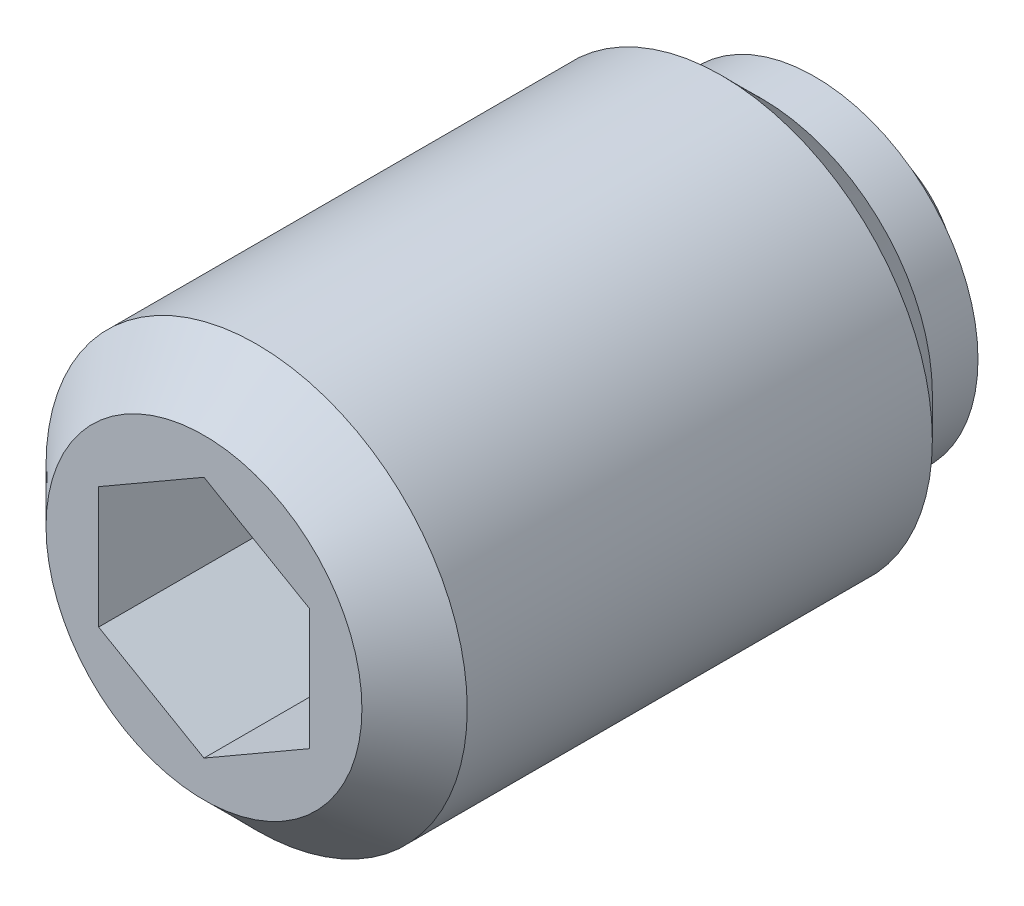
ISO-10303-21;
HEADER;
FILE_DESCRIPTION(('STEP AP214'),'2;1');
FILE_NAME('part.step','',(''),(''),'','','');
FILE_SCHEMA(('AUTOMOTIVE_DESIGN { 1 0 10303 214 1 1 1 1 }'));
ENDSEC;
DATA;
#1=APPLICATION_CONTEXT('core data for automotive mechanical design processes');
#2=APPLICATION_PROTOCOL_DEFINITION('international standard','automotive_design',2000,#1);
#3=PRODUCT_CONTEXT('',#1,'mechanical');
#4=PRODUCT('Part','Part','',(#3));
#5=PRODUCT_RELATED_PRODUCT_CATEGORY('part','',(#4));
#6=PRODUCT_DEFINITION_FORMATION('','',#4);
#7=PRODUCT_DEFINITION_CONTEXT('part definition',#1,'design');
#8=PRODUCT_DEFINITION('design','',#6,#7);
#9=PRODUCT_DEFINITION_SHAPE('','',#8);
#10=(LENGTH_UNIT() NAMED_UNIT(*) SI_UNIT(.MILLI.,.METRE.));
#11=(NAMED_UNIT(*) PLANE_ANGLE_UNIT() SI_UNIT($,.RADIAN.));
#12=(NAMED_UNIT(*) SI_UNIT($,.STERADIAN.) SOLID_ANGLE_UNIT());
#13=UNCERTAINTY_MEASURE_WITH_UNIT(LENGTH_MEASURE(1.E-05),#10,'distance_accuracy_value','');
#14=(GEOMETRIC_REPRESENTATION_CONTEXT(3) GLOBAL_UNCERTAINTY_ASSIGNED_CONTEXT((#13)) GLOBAL_UNIT_ASSIGNED_CONTEXT((#10,
#11,#12)) REPRESENTATION_CONTEXT('',''));
#15=CARTESIAN_POINT('',(0.,0.,0.));
#16=DIRECTION('',(0.,0.,1.));
#17=DIRECTION('',(1.,0.,0.));
#18=AXIS2_PLACEMENT_3D('',#15,#16,#17);
#19=CARTESIAN_POINT('',(0.,0.,10.2));
#20=DIRECTION('',(0.,0.,-1.));
#21=DIRECTION('',(-1.,0.,0.));
#22=AXIS2_PLACEMENT_3D('',#19,#20,#21);
#23=PLANE('',#22);
#24=DIRECTION('',(0.,1.,0.));
#25=VECTOR('',#24,1.);
#26=CARTESIAN_POINT('',(-2.,-1.15470053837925,10.2));
#27=LINE('',#26,#25);
#28=CARTESIAN_POINT('',(-2.,-1.15470053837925,10.2));
#29=VERTEX_POINT('',#28);
#30=CARTESIAN_POINT('',(-2.,1.15470053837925,10.2));
#31=VERTEX_POINT('',#30);
#32=EDGE_CURVE('E80',#29,#31,#27,.T.);
#33=ORIENTED_EDGE('',*,*,#32,.F.);
#34=DIRECTION('',(0.866025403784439,-0.5,0.));
#35=VECTOR('',#34,1.);
#36=CARTESIAN_POINT('',(0.,-2.3094010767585,10.2));
#37=LINE('',#36,#35);
#38=CARTESIAN_POINT('',(0.,-2.3094010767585,10.2));
#39=VERTEX_POINT('',#38);
#40=EDGE_CURVE('E102',#39,#29,#37,.F.);
#41=ORIENTED_EDGE('',*,*,#40,.F.);
#42=DIRECTION('',(-0.866025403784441,-0.5,0.));
#43=VECTOR('',#42,1.);
#44=CARTESIAN_POINT('',(1.,-1.73205080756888,10.2));
#45=LINE('',#44,#43);
#46=CARTESIAN_POINT('',(2.,-1.15470053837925,10.2));
#47=VERTEX_POINT('',#46);
#48=EDGE_CURVE('E81',#47,#39,#45,.T.);
#49=ORIENTED_EDGE('',*,*,#48,.F.);
#50=DIRECTION('',(0.,1.,0.));
#51=VECTOR('',#50,1.);
#52=CARTESIAN_POINT('',(2.,0.,10.2));
#53=LINE('',#52,#51);
#54=CARTESIAN_POINT('',(2.,1.15470053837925,10.2));
#55=VERTEX_POINT('',#54);
#56=EDGE_CURVE('E64',#55,#47,#53,.F.);
#57=ORIENTED_EDGE('',*,*,#56,.F.);
#58=DIRECTION('',(0.866025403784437,-0.5,0.));
#59=VECTOR('',#58,1.);
#60=CARTESIAN_POINT('',(1.,1.73205080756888,10.2));
#61=LINE('',#60,#59);
#62=CARTESIAN_POINT('',(0.,2.3094010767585,10.2));
#63=VERTEX_POINT('',#62);
#64=EDGE_CURVE('E67',#63,#55,#61,.T.);
#65=ORIENTED_EDGE('',*,*,#64,.F.);
#66=DIRECTION('',(0.866025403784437,0.5,0.));
#67=VECTOR('',#66,1.);
#68=CARTESIAN_POINT('',(-2.,1.15470053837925,10.2));
#69=LINE('',#68,#67);
#70=EDGE_CURVE('E69',#31,#63,#69,.T.);
#71=ORIENTED_EDGE('',*,*,#70,.F.);
#72=EDGE_LOOP('',(#33,#41,#49,#57,#65,#71));
#73=FACE_BOUND('',#72,.T.);
#74=ADVANCED_FACE('F14',(#73),#23,.F.);
#75=CARTESIAN_POINT('',(-2.,-1.15470053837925,10.2));
#76=DIRECTION('',(1.,0.,0.));
#77=DIRECTION('',(0.,0.,-1.));
#78=AXIS2_PLACEMENT_3D('',#75,#76,#77);
#79=PLANE('',#78);
#80=ORIENTED_EDGE('',*,*,#32,.T.);
#81=DIRECTION('',(0.,0.,-1.));
#82=VECTOR('',#81,1.);
#83=CARTESIAN_POINT('',(-2.,1.15470053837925,10.2));
#84=LINE('',#83,#82);
#85=CARTESIAN_POINT('',(-2.,1.15470053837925,13.2));
#86=VERTEX_POINT('',#85);
#87=EDGE_CURVE('E79',#86,#31,#84,.T.);
#88=ORIENTED_EDGE('',*,*,#87,.F.);
#89=DIRECTION('',(0.,1.,0.));
#90=VECTOR('',#89,1.);
#91=CARTESIAN_POINT('',(-2.,0.,13.2));
#92=LINE('',#91,#90);
#93=CARTESIAN_POINT('',(-2.,-1.15470053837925,13.2));
#94=VERTEX_POINT('',#93);
#95=EDGE_CURVE('E84',#86,#94,#92,.F.);
#96=ORIENTED_EDGE('',*,*,#95,.T.);
#97=DIRECTION('',(0.,0.,-1.));
#98=VECTOR('',#97,1.);
#99=CARTESIAN_POINT('',(-2.,-1.15470053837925,10.2));
#100=LINE('',#99,#98);
#101=EDGE_CURVE('E96',#29,#94,#100,.F.);
#102=ORIENTED_EDGE('',*,*,#101,.F.);
#103=EDGE_LOOP('',(#80,#88,#96,#102));
#104=FACE_BOUND('',#103,.T.);
#105=ADVANCED_FACE('F169',(#104),#79,.T.);
#106=CARTESIAN_POINT('',(0.,-2.3094010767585,10.2));
#107=DIRECTION('',(0.5,0.866025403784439,0.));
#108=DIRECTION('',(0.866025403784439,-0.5,0.));
#109=AXIS2_PLACEMENT_3D('',#106,#107,#108);
#110=PLANE('',#109);
#111=ORIENTED_EDGE('',*,*,#40,.T.);
#112=ORIENTED_EDGE('',*,*,#101,.T.);
#113=DIRECTION('',(0.866025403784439,-0.5,0.));
#114=VECTOR('',#113,1.);
#115=CARTESIAN_POINT('',(-2.,-1.15470053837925,13.2));
#116=LINE('',#115,#114);
#117=CARTESIAN_POINT('',(0.,-2.3094010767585,13.2));
#118=VERTEX_POINT('',#117);
#119=EDGE_CURVE('E85',#94,#118,#116,.T.);
#120=ORIENTED_EDGE('',*,*,#119,.T.);
#121=DIRECTION('',(0.,0.,-1.));
#122=VECTOR('',#121,1.);
#123=CARTESIAN_POINT('',(0.,-2.3094010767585,10.2));
#124=LINE('',#123,#122);
#125=EDGE_CURVE('E94',#39,#118,#124,.F.);
#126=ORIENTED_EDGE('',*,*,#125,.F.);
#127=EDGE_LOOP('',(#111,#112,#120,#126));
#128=FACE_BOUND('',#127,.T.);
#129=ADVANCED_FACE('F173',(#128),#110,.T.);
#130=CARTESIAN_POINT('',(2.,-1.15470053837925,10.2));
#131=DIRECTION('',(-0.5,0.866025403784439,0.));
#132=DIRECTION('',(0.866025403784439,0.5,0.));
#133=AXIS2_PLACEMENT_3D('',#130,#131,#132);
#134=PLANE('',#133);
#135=ORIENTED_EDGE('',*,*,#48,.T.);
#136=ORIENTED_EDGE('',*,*,#125,.T.);
#137=DIRECTION('',(0.866025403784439,0.5,0.));
#138=VECTOR('',#137,1.);
#139=CARTESIAN_POINT('',(0.,-2.3094010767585,13.2));
#140=LINE('',#139,#138);
#141=CARTESIAN_POINT('',(2.,-1.15470053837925,13.2));
#142=VERTEX_POINT('',#141);
#143=EDGE_CURVE('E108',#118,#142,#140,.T.);
#144=ORIENTED_EDGE('',*,*,#143,.T.);
#145=DIRECTION('',(0.,0.,1.));
#146=VECTOR('',#145,1.);
#147=CARTESIAN_POINT('',(2.,-1.15470053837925,10.2));
#148=LINE('',#147,#146);
#149=EDGE_CURVE('E91',#47,#142,#148,.T.);
#150=ORIENTED_EDGE('',*,*,#149,.F.);
#151=EDGE_LOOP('',(#135,#136,#144,#150));
#152=FACE_BOUND('',#151,.T.);
#153=ADVANCED_FACE('F178',(#152),#134,.T.);
#154=CARTESIAN_POINT('',(2.,1.15470053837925,10.2));
#155=DIRECTION('',(-1.,0.,0.));
#156=DIRECTION('',(0.,0.,1.));
#157=AXIS2_PLACEMENT_3D('',#154,#155,#156);
#158=PLANE('',#157);
#159=ORIENTED_EDGE('',*,*,#56,.T.);
#160=ORIENTED_EDGE('',*,*,#149,.T.);
#161=DIRECTION('',(0.,1.,0.));
#162=VECTOR('',#161,1.);
#163=CARTESIAN_POINT('',(2.,0.,13.2));
#164=LINE('',#163,#162);
#165=CARTESIAN_POINT('',(2.,1.15470053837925,13.2));
#166=VERTEX_POINT('',#165);
#167=EDGE_CURVE('E110',#142,#166,#164,.T.);
#168=ORIENTED_EDGE('',*,*,#167,.T.);
#169=DIRECTION('',(0.,0.,-1.));
#170=VECTOR('',#169,1.);
#171=CARTESIAN_POINT('',(2.,1.15470053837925,10.2));
#172=LINE('',#171,#170);
#173=EDGE_CURVE('E87',#55,#166,#172,.F.);
#174=ORIENTED_EDGE('',*,*,#173,.F.);
#175=EDGE_LOOP('',(#159,#160,#168,#174));
#176=FACE_BOUND('',#175,.T.);
#177=ADVANCED_FACE('F184',(#176),#158,.T.);
#178=CARTESIAN_POINT('',(0.,2.3094010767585,10.2));
#179=DIRECTION('',(-0.5,-0.866025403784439,0.));
#180=DIRECTION('',(-0.866025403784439,0.5,0.));
#181=AXIS2_PLACEMENT_3D('',#178,#179,#180);
#182=PLANE('',#181);
#183=ORIENTED_EDGE('',*,*,#64,.T.);
#184=ORIENTED_EDGE('',*,*,#173,.T.);
#185=DIRECTION('',(-0.866025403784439,0.5,0.));
#186=VECTOR('',#185,1.);
#187=CARTESIAN_POINT('',(2.,1.15470053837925,13.2));
#188=LINE('',#187,#186);
#189=CARTESIAN_POINT('',(0.,2.3094010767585,13.2));
#190=VERTEX_POINT('',#189);
#191=EDGE_CURVE('E31',#166,#190,#188,.T.);
#192=ORIENTED_EDGE('',*,*,#191,.T.);
#193=DIRECTION('',(0.,0.,-1.));
#194=VECTOR('',#193,1.);
#195=CARTESIAN_POINT('',(0.,2.3094010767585,10.2));
#196=LINE('',#195,#194);
#197=EDGE_CURVE('E77',#63,#190,#196,.F.);
#198=ORIENTED_EDGE('',*,*,#197,.F.);
#199=EDGE_LOOP('',(#183,#184,#192,#198));
#200=FACE_BOUND('',#199,.T.);
#201=ADVANCED_FACE('F83',(#200),#182,.T.);
#202=CARTESIAN_POINT('',(-2.,1.15470053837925,10.2));
#203=DIRECTION('',(0.5,-0.866025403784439,0.));
#204=DIRECTION('',(-0.866025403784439,-0.5,0.));
#205=AXIS2_PLACEMENT_3D('',#202,#203,#204);
#206=PLANE('',#205);
#207=ORIENTED_EDGE('',*,*,#70,.T.);
#208=ORIENTED_EDGE('',*,*,#197,.T.);
#209=DIRECTION('',(-0.866025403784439,-0.5,0.));
#210=VECTOR('',#209,1.);
#211=CARTESIAN_POINT('',(0.,2.3094010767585,13.2));
#212=LINE('',#211,#210);
#213=EDGE_CURVE('E113',#190,#86,#212,.T.);
#214=ORIENTED_EDGE('',*,*,#213,.T.);
#215=ORIENTED_EDGE('',*,*,#87,.T.);
#216=EDGE_LOOP('',(#207,#208,#214,#215));
#217=FACE_BOUND('',#216,.T.);
#218=ADVANCED_FACE('F75',(#217),#206,.T.);
#219=CARTESIAN_POINT('',(0.,0.,13.2));
#220=DIRECTION('',(0.,0.,-1.));
#221=DIRECTION('',(-1.,0.,0.));
#222=AXIS2_PLACEMENT_3D('',#219,#220,#221);
#223=PLANE('',#222);
#224=ORIENTED_EDGE('',*,*,#191,.F.);
#225=ORIENTED_EDGE('',*,*,#167,.F.);
#226=ORIENTED_EDGE('',*,*,#143,.F.);
#227=ORIENTED_EDGE('',*,*,#119,.F.);
#228=ORIENTED_EDGE('',*,*,#95,.F.);
#229=ORIENTED_EDGE('',*,*,#213,.F.);
#230=EDGE_LOOP('',(#224,#225,#226,#227,#228,#229));
#231=FACE_BOUND('',#230,.T.);
#232=CARTESIAN_POINT('',(0.,0.,13.1999999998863));
#233=DIRECTION('',(0.,0.,-1.));
#234=DIRECTION('',(-1.,0.,0.));
#235=AXIS2_PLACEMENT_3D('',#232,#233,#234);
#236=CIRCLE('',#235,2.99999999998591);
#237=CARTESIAN_POINT('',(-2.99999999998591,0.,13.1999999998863));
#238=VERTEX_POINT('',#237);
#239=EDGE_CURVE('E17',#238,#238,#236,.T.);
#240=ORIENTED_EDGE('',*,*,#239,.F.);
#241=EDGE_LOOP('',(#240));
#242=FACE_BOUND('',#241,.T.);
#243=ADVANCED_FACE('F193',(#231,#242),#223,.F.);
#244=CARTESIAN_POINT('',(0.,0.,12.2000000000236));
#245=DIRECTION('',(0.,0.,-1.));
#246=DIRECTION('',(-1.,0.,0.));
#247=AXIS2_PLACEMENT_3D('',#244,#245,#246);
#248=CONICAL_SURFACE('',#247,3.99999999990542,0.785398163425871);
#249=ORIENTED_EDGE('',*,*,#239,.T.);
#250=EDGE_LOOP('',(#249));
#251=FACE_BOUND('',#250,.T.);
#252=CARTESIAN_POINT('',(0.,0.,12.2));
#253=DIRECTION('',(0.,0.,1.));
#254=DIRECTION('',(1.,0.,0.));
#255=AXIS2_PLACEMENT_3D('',#252,#253,#254);
#256=CIRCLE('',#255,4.);
#257=CARTESIAN_POINT('',(4.,0.,12.2));
#258=VERTEX_POINT('',#257);
#259=EDGE_CURVE('E9',#258,#258,#256,.F.);
#260=ORIENTED_EDGE('',*,*,#259,.F.);
#261=EDGE_LOOP('',(#260));
#262=FACE_BOUND('',#261,.T.);
#263=ADVANCED_FACE('F165',(#251,#262),#248,.T.);
#264=CARTESIAN_POINT('',(0.,0.,3.6));
#265=DIRECTION('',(0.,0.,1.));
#266=DIRECTION('',(1.,0.,0.));
#267=AXIS2_PLACEMENT_3D('',#264,#265,#266);
#268=CYLINDRICAL_SURFACE('',#267,4.);
#269=ORIENTED_EDGE('',*,*,#259,.T.);
#270=EDGE_LOOP('',(#269));
#271=FACE_BOUND('',#270,.T.);
#272=CARTESIAN_POINT('',(0.,0.,3.36700000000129));
#273=DIRECTION('',(0.,0.,1.));
#274=DIRECTION('',(1.,0.,0.));
#275=AXIS2_PLACEMENT_3D('',#272,#273,#274);
#276=CIRCLE('',#275,4.);
#277=CARTESIAN_POINT('',(4.,0.,3.36700000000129));
#278=VERTEX_POINT('',#277);
#279=EDGE_CURVE('E128',#278,#278,#276,.T.);
#280=ORIENTED_EDGE('',*,*,#279,.T.);
#281=EDGE_LOOP('',(#280));
#282=FACE_BOUND('',#281,.T.);
#283=ADVANCED_FACE('F132',(#271,#282),#268,.T.);
#284=CARTESIAN_POINT('',(0.,0.,2.75));
#285=DIRECTION('',(0.,0.,1.));
#286=DIRECTION('',(0.,1.,0.));
#287=AXIS2_PLACEMENT_3D('',#284,#285,#286);
#288=SPHERICAL_SURFACE('',#287,2.75);
#289=CARTESIAN_POINT('',(0.,0.,1.6));
#290=DIRECTION('',(0.,0.,1.));
#291=DIRECTION('',(1.,0.,0.));
#292=AXIS2_PLACEMENT_3D('',#289,#290,#291);
#293=CIRCLE('',#292,2.49799919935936);
#294=CARTESIAN_POINT('',(2.49799919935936,0.,1.6));
#295=VERTEX_POINT('',#294);
#296=EDGE_CURVE('E71',#295,#295,#293,.T.);
#297=ORIENTED_EDGE('',*,*,#296,.F.);
#298=EDGE_LOOP('',(#297));
#299=FACE_BOUND('',#298,.T.);
#300=ADVANCED_FACE('F155',(#299),#288,.T.);
#301=CARTESIAN_POINT('',(0.,2.49799919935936,1.6));
#302=DIRECTION('',(0.,0.,1.));
#303=DIRECTION('',(1.,0.,0.));
#304=AXIS2_PLACEMENT_3D('',#301,#302,#303);
#305=PLANE('',#304);
#306=CARTESIAN_POINT('',(0.,0.,1.6));
#307=DIRECTION('',(0.,0.,1.));
#308=DIRECTION('',(1.,0.,0.));
#309=AXIS2_PLACEMENT_3D('',#306,#307,#308);
#310=CIRCLE('',#309,3.10000000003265);
#311=CARTESIAN_POINT('',(3.10000000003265,0.,1.6));
#312=VERTEX_POINT('',#311);
#313=EDGE_CURVE('E119',#312,#312,#310,.T.);
#314=ORIENTED_EDGE('',*,*,#313,.F.);
#315=EDGE_LOOP('',(#314));
#316=FACE_BOUND('',#315,.T.);
#317=ORIENTED_EDGE('',*,*,#296,.T.);
#318=EDGE_LOOP('',(#317));
#319=FACE_BOUND('',#318,.T.);
#320=ADVANCED_FACE('F149',(#316,#319),#305,.F.);
#321=CARTESIAN_POINT('',(0.,0.,16.478518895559));
#322=DIRECTION('',(0.,0.,1.));
#323=DIRECTION('',(1.,0.,0.));
#324=AXIS2_PLACEMENT_3D('',#321,#322,#323);
#325=CYLINDRICAL_SURFACE('',#324,3.10000000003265);
#326=CARTESIAN_POINT('',(0.,0.,2.6));
#327=DIRECTION('',(0.,0.,1.));
#328=DIRECTION('',(1.,0.,0.));
#329=AXIS2_PLACEMENT_3D('',#326,#327,#328);
#330=CIRCLE('',#329,3.10000000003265);
#331=CARTESIAN_POINT('',(3.10000000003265,0.,2.6));
#332=VERTEX_POINT('',#331);
#333=EDGE_CURVE('E122',#332,#332,#330,.T.);
#334=ORIENTED_EDGE('',*,*,#333,.F.);
#335=EDGE_LOOP('',(#334));
#336=FACE_BOUND('',#335,.T.);
#337=ORIENTED_EDGE('',*,*,#313,.T.);
#338=EDGE_LOOP('',(#337));
#339=FACE_BOUND('',#338,.T.);
#340=ADVANCED_FACE('F143',(#336,#339),#325,.T.);
#341=CARTESIAN_POINT('',(0.,3.10000000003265,2.6));
#342=DIRECTION('',(0.,0.,1.));
#343=DIRECTION('',(1.,0.,0.));
#344=AXIS2_PLACEMENT_3D('',#341,#342,#343);
#345=PLANE('',#344);
#346=CARTESIAN_POINT('',(0.,0.,2.6));
#347=DIRECTION('',(0.,0.,1.));
#348=DIRECTION('',(1.,0.,0.));
#349=AXIS2_PLACEMENT_3D('',#346,#347,#348);
#350=CIRCLE('',#349,3.23299999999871);
#351=CARTESIAN_POINT('',(3.23299999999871,0.,2.6));
#352=VERTEX_POINT('',#351);
#353=EDGE_CURVE('E125',#352,#352,#350,.T.);
#354=ORIENTED_EDGE('',*,*,#353,.F.);
#355=EDGE_LOOP('',(#354));
#356=FACE_BOUND('',#355,.T.);
#357=ORIENTED_EDGE('',*,*,#333,.T.);
#358=EDGE_LOOP('',(#357));
#359=FACE_BOUND('',#358,.T.);
#360=ADVANCED_FACE('F137',(#356,#359),#345,.F.);
#361=CARTESIAN_POINT('',(0.,0.,2.6));
#362=DIRECTION('',(0.,0.,1.));
#363=DIRECTION('',(1.,0.,0.));
#364=AXIS2_PLACEMENT_3D('',#361,#362,#363);
#365=CONICAL_SURFACE('',#364,3.23299999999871,0.785398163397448);
#366=ORIENTED_EDGE('',*,*,#279,.F.);
#367=EDGE_LOOP('',(#366));
#368=FACE_BOUND('',#367,.T.);
#369=ORIENTED_EDGE('',*,*,#353,.T.);
#370=EDGE_LOOP('',(#369));
#371=FACE_BOUND('',#370,.T.);
#372=ADVANCED_FACE('F134',(#368,#371),#365,.T.);
#373=CLOSED_SHELL('',(#74,#105,#129,#153,#177,#201,#218,#243,#263,#283,#300,#320,#340,#360,#372));
#374=MANIFOLD_SOLID_BREP('B1',#373);
#375=ADVANCED_BREP_SHAPE_REPRESENTATION('',(#18,#374),#14);
#376=SHAPE_DEFINITION_REPRESENTATION(#9,#375);
ENDSEC;
END-ISO-10303-21;
